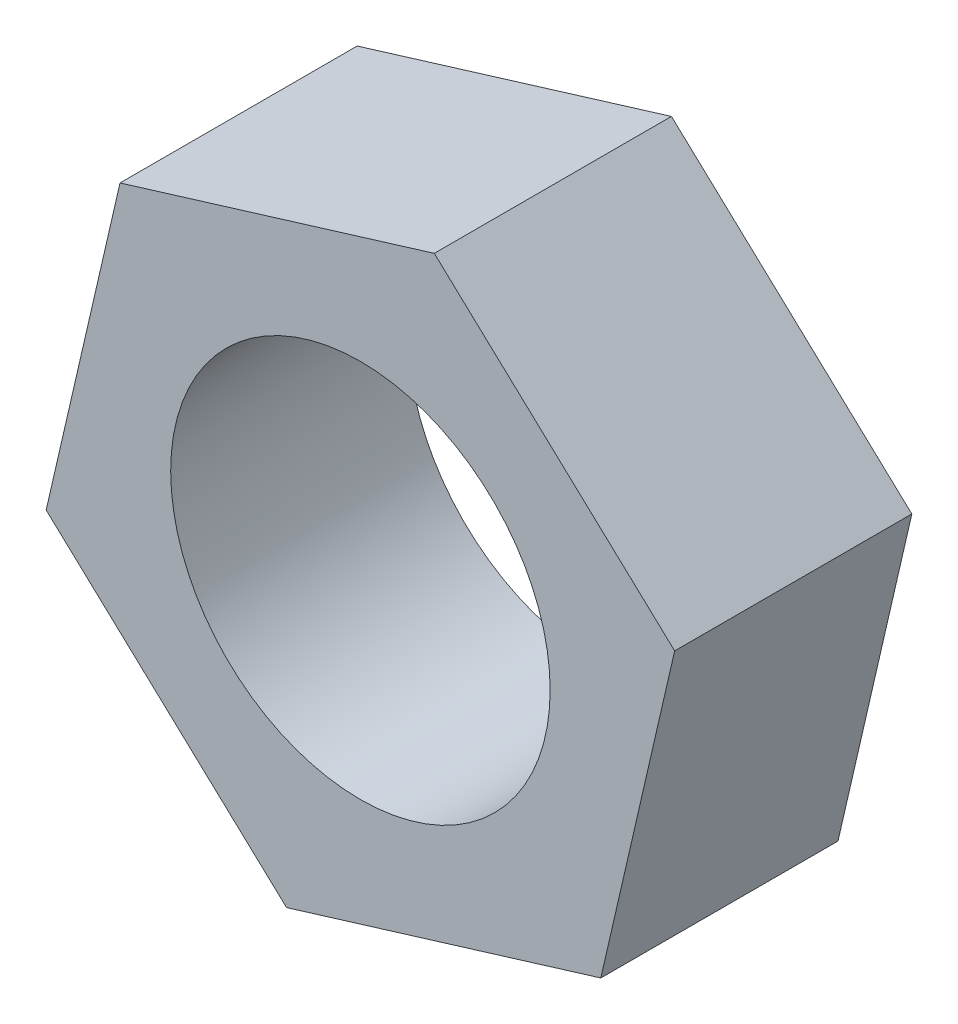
ISO-10303-21;
HEADER;
FILE_DESCRIPTION(('STEP AP214'),'2;1');
FILE_NAME('part.step','',(''),(''),'','','');
FILE_SCHEMA(('AUTOMOTIVE_DESIGN { 1 0 10303 214 1 1 1 1 }'));
ENDSEC;
DATA;
#1=APPLICATION_CONTEXT('core data for automotive mechanical design processes');
#2=APPLICATION_PROTOCOL_DEFINITION('international standard','automotive_design',2000,#1);
#3=PRODUCT_CONTEXT('',#1,'mechanical');
#4=PRODUCT('Part','Part','',(#3));
#5=PRODUCT_RELATED_PRODUCT_CATEGORY('part','',(#4));
#6=PRODUCT_DEFINITION_FORMATION('','',#4);
#7=PRODUCT_DEFINITION_CONTEXT('part definition',#1,'design');
#8=PRODUCT_DEFINITION('design','',#6,#7);
#9=PRODUCT_DEFINITION_SHAPE('','',#8);
#10=(LENGTH_UNIT() NAMED_UNIT(*) SI_UNIT(.MILLI.,.METRE.));
#11=(NAMED_UNIT(*) PLANE_ANGLE_UNIT() SI_UNIT($,.RADIAN.));
#12=(NAMED_UNIT(*) SI_UNIT($,.STERADIAN.) SOLID_ANGLE_UNIT());
#13=UNCERTAINTY_MEASURE_WITH_UNIT(LENGTH_MEASURE(1.E-05),#10,'distance_accuracy_value','');
#14=(GEOMETRIC_REPRESENTATION_CONTEXT(3) GLOBAL_UNCERTAINTY_ASSIGNED_CONTEXT((#13)) GLOBAL_UNIT_ASSIGNED_CONTEXT((#10,
#11,#12)) REPRESENTATION_CONTEXT('',''));
#15=CARTESIAN_POINT('',(0.,0.,0.));
#16=DIRECTION('',(0.,0.,1.));
#17=DIRECTION('',(1.,0.,0.));
#18=AXIS2_PLACEMENT_3D('',#15,#16,#17);
#19=CARTESIAN_POINT('',(0.,0.,6.35));
#20=DIRECTION('',(0.,0.,1.));
#21=DIRECTION('',(1.,0.,0.));
#22=AXIS2_PLACEMENT_3D('',#19,#20,#21);
#23=PLANE('',#22);
#24=DIRECTION('',(0.95623961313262,0.292584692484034,0.));
#25=VECTOR('',#24,1.);
#26=CARTESIAN_POINT('',(-1.97739385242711,-8.57374559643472,6.35));
#27=LINE('',#26,#25);
#28=CARTESIAN_POINT('',(-1.97739385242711,-8.57374559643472,6.35));
#29=VERTEX_POINT('',#28);
#30=CARTESIAN_POINT('',(6.43638456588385,-5.99934610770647,6.35));
#31=VERTEX_POINT('',#30);
#32=EDGE_CURVE('E129',#29,#31,#27,.T.);
#33=ORIENTED_EDGE('',*,*,#32,.T.);
#34=DIRECTION('',(0.22473403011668,0.97442014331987,0.));
#35=VECTOR('',#34,1.);
#36=CARTESIAN_POINT('',(6.43638456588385,-5.99934610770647,6.35));
#37=LINE('',#36,#35);
#38=CARTESIAN_POINT('',(8.41377841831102,2.57439948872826,6.35));
#39=VERTEX_POINT('',#38);
#40=EDGE_CURVE('E87',#31,#39,#37,.T.);
#41=ORIENTED_EDGE('',*,*,#40,.T.);
#42=DIRECTION('',(-0.731505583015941,0.681835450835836,0.));
#43=VECTOR('',#42,1.);
#44=CARTESIAN_POINT('',(8.41377841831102,2.57439948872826,6.35));
#45=LINE('',#44,#43);
#46=CARTESIAN_POINT('',(1.97739385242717,8.57374559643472,6.35));
#47=VERTEX_POINT('',#46);
#48=EDGE_CURVE('E100',#39,#47,#45,.T.);
#49=ORIENTED_EDGE('',*,*,#48,.T.);
#50=DIRECTION('',(-0.95623961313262,-0.292584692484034,0.));
#51=VECTOR('',#50,1.);
#52=CARTESIAN_POINT('',(1.97739385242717,8.57374559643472,6.35));
#53=LINE('',#52,#51);
#54=CARTESIAN_POINT('',(-6.43638456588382,5.99934610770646,6.35));
#55=VERTEX_POINT('',#54);
#56=EDGE_CURVE('E94',#47,#55,#53,.T.);
#57=ORIENTED_EDGE('',*,*,#56,.T.);
#58=DIRECTION('',(-0.224734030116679,-0.97442014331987,0.));
#59=VECTOR('',#58,1.);
#60=CARTESIAN_POINT('',(-6.43638456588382,5.99934610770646,6.35));
#61=LINE('',#60,#59);
#62=CARTESIAN_POINT('',(-8.41377841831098,-2.57439948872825,6.35));
#63=VERTEX_POINT('',#62);
#64=EDGE_CURVE('E98',#55,#63,#61,.T.);
#65=ORIENTED_EDGE('',*,*,#64,.T.);
#66=DIRECTION('',(0.731505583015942,-0.681835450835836,0.));
#67=VECTOR('',#66,1.);
#68=CARTESIAN_POINT('',(-8.41377841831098,-2.57439948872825,6.35));
#69=LINE('',#68,#67);
#70=EDGE_CURVE('E50',#63,#29,#69,.T.);
#71=ORIENTED_EDGE('',*,*,#70,.T.);
#72=EDGE_LOOP('',(#33,#41,#49,#57,#65,#71));
#73=FACE_BOUND('',#72,.T.);
#74=CARTESIAN_POINT('',(0.,0.,6.35));
#75=DIRECTION('',(0.,0.,1.));
#76=DIRECTION('',(1.,0.,0.));
#77=AXIS2_PLACEMENT_3D('',#74,#75,#76);
#78=CIRCLE('',#77,5.08);
#79=CARTESIAN_POINT('',(5.08,0.,6.35));
#80=VERTEX_POINT('',#79);
#81=EDGE_CURVE('E122',#80,#80,#78,.T.);
#82=ORIENTED_EDGE('',*,*,#81,.F.);
#83=EDGE_LOOP('',(#82));
#84=FACE_BOUND('',#83,.T.);
#85=ADVANCED_FACE('F33',(#73,#84),#23,.T.);
#86=CARTESIAN_POINT('',(0.,0.,0.));
#87=DIRECTION('',(0.,0.,1.));
#88=DIRECTION('',(1.,0.,0.));
#89=AXIS2_PLACEMENT_3D('',#86,#87,#88);
#90=PLANE('',#89);
#91=DIRECTION('',(0.95623961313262,0.292584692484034,0.));
#92=VECTOR('',#91,1.);
#93=CARTESIAN_POINT('',(-1.97739385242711,-8.57374559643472,0.));
#94=LINE('',#93,#92);
#95=CARTESIAN_POINT('',(-1.97739385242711,-8.57374559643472,0.));
#96=VERTEX_POINT('',#95);
#97=CARTESIAN_POINT('',(6.43638456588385,-5.99934610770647,0.));
#98=VERTEX_POINT('',#97);
#99=EDGE_CURVE('E118',#96,#98,#94,.T.);
#100=ORIENTED_EDGE('',*,*,#99,.F.);
#101=DIRECTION('',(0.731505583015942,-0.681835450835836,0.));
#102=VECTOR('',#101,1.);
#103=CARTESIAN_POINT('',(-8.41377841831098,-2.57439948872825,0.));
#104=LINE('',#103,#102);
#105=CARTESIAN_POINT('',(-8.41377841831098,-2.57439948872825,0.));
#106=VERTEX_POINT('',#105);
#107=EDGE_CURVE('E79',#106,#96,#104,.T.);
#108=ORIENTED_EDGE('',*,*,#107,.F.);
#109=DIRECTION('',(-0.224734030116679,-0.97442014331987,0.));
#110=VECTOR('',#109,1.);
#111=CARTESIAN_POINT('',(-6.43638456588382,5.99934610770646,0.));
#112=LINE('',#111,#110);
#113=CARTESIAN_POINT('',(-6.43638456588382,5.99934610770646,0.));
#114=VERTEX_POINT('',#113);
#115=EDGE_CURVE('E73',#114,#106,#112,.T.);
#116=ORIENTED_EDGE('',*,*,#115,.F.);
#117=DIRECTION('',(-0.95623961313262,-0.292584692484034,0.));
#118=VECTOR('',#117,1.);
#119=CARTESIAN_POINT('',(1.97739385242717,8.57374559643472,0.));
#120=LINE('',#119,#118);
#121=CARTESIAN_POINT('',(1.97739385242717,8.57374559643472,0.));
#122=VERTEX_POINT('',#121);
#123=EDGE_CURVE('E108',#122,#114,#120,.T.);
#124=ORIENTED_EDGE('',*,*,#123,.F.);
#125=DIRECTION('',(-0.731505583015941,0.681835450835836,0.));
#126=VECTOR('',#125,1.);
#127=CARTESIAN_POINT('',(8.41377841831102,2.57439948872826,0.));
#128=LINE('',#127,#126);
#129=CARTESIAN_POINT('',(8.41377841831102,2.57439948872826,0.));
#130=VERTEX_POINT('',#129);
#131=EDGE_CURVE('E124',#130,#122,#128,.T.);
#132=ORIENTED_EDGE('',*,*,#131,.F.);
#133=DIRECTION('',(0.22473403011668,0.97442014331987,0.));
#134=VECTOR('',#133,1.);
#135=CARTESIAN_POINT('',(6.43638456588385,-5.99934610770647,0.));
#136=LINE('',#135,#134);
#137=EDGE_CURVE('E121',#98,#130,#136,.T.);
#138=ORIENTED_EDGE('',*,*,#137,.F.);
#139=EDGE_LOOP('',(#100,#108,#116,#124,#132,#138));
#140=FACE_BOUND('',#139,.T.);
#141=CARTESIAN_POINT('',(0.,0.,0.));
#142=DIRECTION('',(0.,0.,1.));
#143=DIRECTION('',(1.,0.,0.));
#144=AXIS2_PLACEMENT_3D('',#141,#142,#143);
#145=CIRCLE('',#144,5.08);
#146=CARTESIAN_POINT('',(5.08,0.,0.));
#147=VERTEX_POINT('',#146);
#148=EDGE_CURVE('E222',#147,#147,#145,.T.);
#149=ORIENTED_EDGE('',*,*,#148,.T.);
#150=EDGE_LOOP('',(#149));
#151=FACE_BOUND('',#150,.T.);
#152=ADVANCED_FACE('F138',(#140,#151),#90,.F.);
#153=CARTESIAN_POINT('',(-1.97739385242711,-8.57374559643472,6.35));
#154=DIRECTION('',(-0.292584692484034,0.95623961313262,0.));
#155=DIRECTION('',(-0.95623961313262,-0.292584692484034,0.));
#156=AXIS2_PLACEMENT_3D('',#153,#154,#155);
#157=PLANE('',#156);
#158=ORIENTED_EDGE('',*,*,#99,.T.);
#159=DIRECTION('',(0.,0.,-1.));
#160=VECTOR('',#159,1.);
#161=CARTESIAN_POINT('',(6.43638456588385,-5.99934610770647,6.35));
#162=LINE('',#161,#160);
#163=EDGE_CURVE('E11',#31,#98,#162,.T.);
#164=ORIENTED_EDGE('',*,*,#163,.F.);
#165=ORIENTED_EDGE('',*,*,#32,.F.);
#166=DIRECTION('',(0.,0.,-1.));
#167=VECTOR('',#166,1.);
#168=CARTESIAN_POINT('',(-1.97739385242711,-8.57374559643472,6.35));
#169=LINE('',#168,#167);
#170=EDGE_CURVE('E114',#29,#96,#169,.T.);
#171=ORIENTED_EDGE('',*,*,#170,.T.);
#172=EDGE_LOOP('',(#158,#164,#165,#171));
#173=FACE_BOUND('',#172,.T.);
#174=ADVANCED_FACE('F35',(#173),#157,.F.);
#175=CARTESIAN_POINT('',(6.43638456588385,-5.99934610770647,6.35));
#176=DIRECTION('',(-0.97442014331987,0.22473403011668,0.));
#177=DIRECTION('',(-0.22473403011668,-0.97442014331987,0.));
#178=AXIS2_PLACEMENT_3D('',#175,#176,#177);
#179=PLANE('',#178);
#180=ORIENTED_EDGE('',*,*,#137,.T.);
#181=DIRECTION('',(0.,0.,-1.));
#182=VECTOR('',#181,1.);
#183=CARTESIAN_POINT('',(8.41377841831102,2.57439948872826,6.35));
#184=LINE('',#183,#182);
#185=EDGE_CURVE('E42',#39,#130,#184,.T.);
#186=ORIENTED_EDGE('',*,*,#185,.F.);
#187=ORIENTED_EDGE('',*,*,#40,.F.);
#188=ORIENTED_EDGE('',*,*,#163,.T.);
#189=EDGE_LOOP('',(#180,#186,#187,#188));
#190=FACE_BOUND('',#189,.T.);
#191=ADVANCED_FACE('F163',(#190),#179,.F.);
#192=CARTESIAN_POINT('',(8.41377841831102,2.57439948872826,6.35));
#193=DIRECTION('',(-0.681835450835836,-0.731505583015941,0.));
#194=DIRECTION('',(0.731505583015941,-0.681835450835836,0.));
#195=AXIS2_PLACEMENT_3D('',#192,#193,#194);
#196=PLANE('',#195);
#197=ORIENTED_EDGE('',*,*,#131,.T.);
#198=DIRECTION('',(0.,0.,-1.));
#199=VECTOR('',#198,1.);
#200=CARTESIAN_POINT('',(1.97739385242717,8.57374559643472,6.35));
#201=LINE('',#200,#199);
#202=EDGE_CURVE('E109',#47,#122,#201,.T.);
#203=ORIENTED_EDGE('',*,*,#202,.F.);
#204=ORIENTED_EDGE('',*,*,#48,.F.);
#205=ORIENTED_EDGE('',*,*,#185,.T.);
#206=EDGE_LOOP('',(#197,#203,#204,#205));
#207=FACE_BOUND('',#206,.T.);
#208=ADVANCED_FACE('F135',(#207),#196,.F.);
#209=CARTESIAN_POINT('',(1.97739385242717,8.57374559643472,6.35));
#210=DIRECTION('',(0.292584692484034,-0.95623961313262,0.));
#211=DIRECTION('',(0.95623961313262,0.292584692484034,0.));
#212=AXIS2_PLACEMENT_3D('',#209,#210,#211);
#213=PLANE('',#212);
#214=ORIENTED_EDGE('',*,*,#123,.T.);
#215=DIRECTION('',(0.,0.,-1.));
#216=VECTOR('',#215,1.);
#217=CARTESIAN_POINT('',(-6.43638456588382,5.99934610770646,6.35));
#218=LINE('',#217,#216);
#219=EDGE_CURVE('E105',#55,#114,#218,.T.);
#220=ORIENTED_EDGE('',*,*,#219,.F.);
#221=ORIENTED_EDGE('',*,*,#56,.F.);
#222=ORIENTED_EDGE('',*,*,#202,.T.);
#223=EDGE_LOOP('',(#214,#220,#221,#222));
#224=FACE_BOUND('',#223,.T.);
#225=ADVANCED_FACE('F106',(#224),#213,.F.);
#226=CARTESIAN_POINT('',(-6.43638456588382,5.99934610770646,6.35));
#227=DIRECTION('',(0.97442014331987,-0.224734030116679,0.));
#228=DIRECTION('',(0.224734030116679,0.97442014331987,0.));
#229=AXIS2_PLACEMENT_3D('',#226,#227,#228);
#230=PLANE('',#229);
#231=ORIENTED_EDGE('',*,*,#115,.T.);
#232=DIRECTION('',(0.,0.,-1.));
#233=VECTOR('',#232,1.);
#234=CARTESIAN_POINT('',(-8.41377841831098,-2.57439948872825,6.35));
#235=LINE('',#234,#233);
#236=EDGE_CURVE('E110',#63,#106,#235,.T.);
#237=ORIENTED_EDGE('',*,*,#236,.F.);
#238=ORIENTED_EDGE('',*,*,#64,.F.);
#239=ORIENTED_EDGE('',*,*,#219,.T.);
#240=EDGE_LOOP('',(#231,#237,#238,#239));
#241=FACE_BOUND('',#240,.T.);
#242=ADVANCED_FACE('F112',(#241),#230,.F.);
#243=CARTESIAN_POINT('',(-8.41377841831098,-2.57439948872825,6.35));
#244=DIRECTION('',(0.681835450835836,0.731505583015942,0.));
#245=DIRECTION('',(-0.731505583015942,0.681835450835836,0.));
#246=AXIS2_PLACEMENT_3D('',#243,#244,#245);
#247=PLANE('',#246);
#248=ORIENTED_EDGE('',*,*,#107,.T.);
#249=ORIENTED_EDGE('',*,*,#170,.F.);
#250=ORIENTED_EDGE('',*,*,#70,.F.);
#251=ORIENTED_EDGE('',*,*,#236,.T.);
#252=EDGE_LOOP('',(#248,#249,#250,#251));
#253=FACE_BOUND('',#252,.T.);
#254=ADVANCED_FACE('F143',(#253),#247,.F.);
#255=CARTESIAN_POINT('',(0.,0.,6.35));
#256=DIRECTION('',(0.,0.,-1.));
#257=DIRECTION('',(-1.,0.,0.));
#258=AXIS2_PLACEMENT_3D('',#255,#256,#257);
#259=CYLINDRICAL_SURFACE('',#258,5.08);
#260=ORIENTED_EDGE('',*,*,#81,.T.);
#261=EDGE_LOOP('',(#260));
#262=FACE_BOUND('',#261,.T.);
#263=ORIENTED_EDGE('',*,*,#148,.F.);
#264=EDGE_LOOP('',(#263));
#265=FACE_BOUND('',#264,.T.);
#266=ADVANCED_FACE('F145',(#262,#265),#259,.F.);
#267=CLOSED_SHELL('',(#85,#152,#174,#191,#208,#225,#242,#254,#266));
#268=MANIFOLD_SOLID_BREP('B2',#267);
#269=ADVANCED_BREP_SHAPE_REPRESENTATION('',(#18,#268),#14);
#270=SHAPE_DEFINITION_REPRESENTATION(#9,#269);
ENDSEC;
END-ISO-10303-21;
